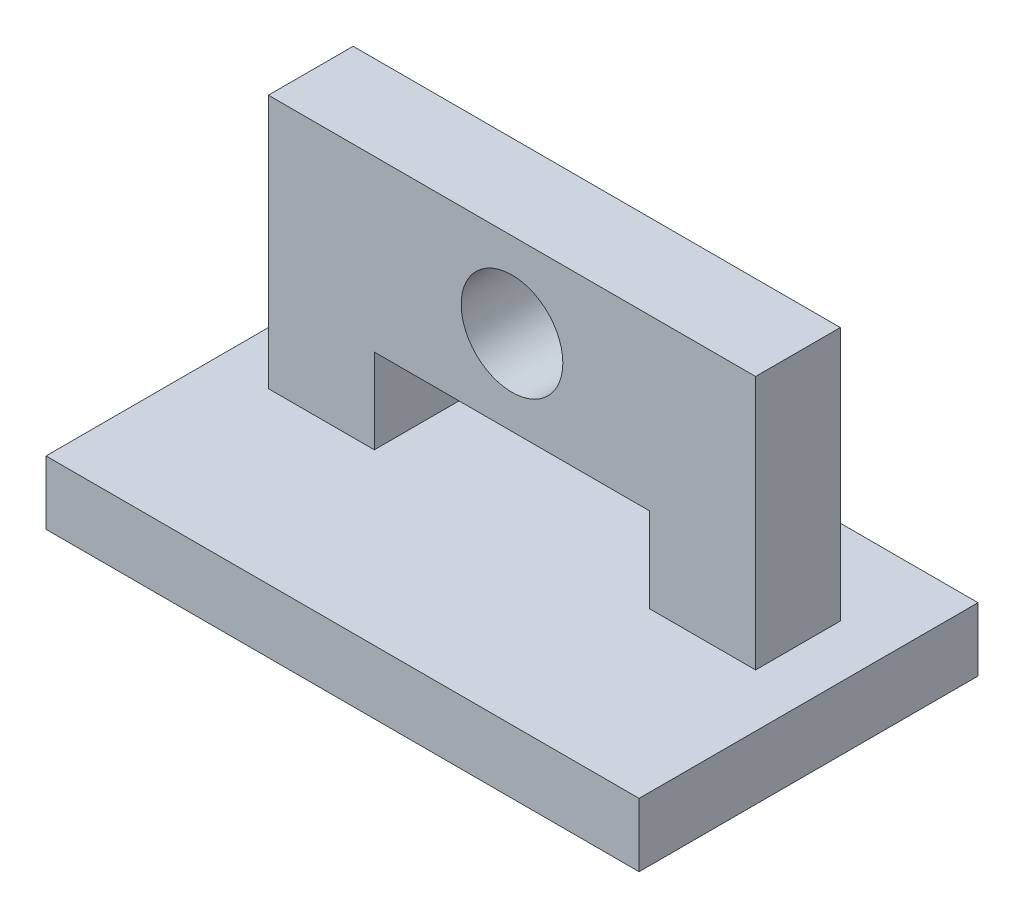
ISO-10303-21;
HEADER;
FILE_DESCRIPTION(('STEP AP214'),'2;1');
FILE_NAME('part.step','',(''),(''),'','','');
FILE_SCHEMA(('AUTOMOTIVE_DESIGN { 1 0 10303 214 1 1 1 1 }'));
ENDSEC;
DATA;
#1=APPLICATION_CONTEXT('core data for automotive mechanical design processes');
#2=APPLICATION_PROTOCOL_DEFINITION('international standard','automotive_design',2000,#1);
#3=PRODUCT_CONTEXT('',#1,'mechanical');
#4=PRODUCT('Part','Part','',(#3));
#5=PRODUCT_RELATED_PRODUCT_CATEGORY('part','',(#4));
#6=PRODUCT_DEFINITION_FORMATION('','',#4);
#7=PRODUCT_DEFINITION_CONTEXT('part definition',#1,'design');
#8=PRODUCT_DEFINITION('design','',#6,#7);
#9=PRODUCT_DEFINITION_SHAPE('','',#8);
#10=(LENGTH_UNIT() NAMED_UNIT(*) SI_UNIT(.MILLI.,.METRE.));
#11=(NAMED_UNIT(*) PLANE_ANGLE_UNIT() SI_UNIT($,.RADIAN.));
#12=(NAMED_UNIT(*) SI_UNIT($,.STERADIAN.) SOLID_ANGLE_UNIT());
#13=UNCERTAINTY_MEASURE_WITH_UNIT(LENGTH_MEASURE(1.E-05),#10,'distance_accuracy_value','');
#14=(GEOMETRIC_REPRESENTATION_CONTEXT(3) GLOBAL_UNCERTAINTY_ASSIGNED_CONTEXT((#13)) GLOBAL_UNIT_ASSIGNED_CONTEXT((#10,
#11,#12)) REPRESENTATION_CONTEXT('',''));
#15=CARTESIAN_POINT('',(0.,0.,0.));
#16=DIRECTION('',(0.,0.,1.));
#17=DIRECTION('',(1.,0.,0.));
#18=AXIS2_PLACEMENT_3D('',#15,#16,#17);
#19=CARTESIAN_POINT('',(0.,0.,0.));
#20=DIRECTION('',(0.,-1.,0.));
#21=DIRECTION('',(0.,0.,-1.));
#22=AXIS2_PLACEMENT_3D('',#19,#20,#21);
#23=PLANE('',#22);
#24=DIRECTION('',(0.,0.,1.));
#25=VECTOR('',#24,1.);
#26=CARTESIAN_POINT('',(32.5,0.,-20.));
#27=LINE('',#26,#25);
#28=CARTESIAN_POINT('',(32.5,0.,-20.));
#29=VERTEX_POINT('',#28);
#30=CARTESIAN_POINT('',(32.5,0.,0.));
#31=VERTEX_POINT('',#30);
#32=EDGE_CURVE('E126',#29,#31,#27,.T.);
#33=ORIENTED_EDGE('',*,*,#32,.F.);
#34=DIRECTION('',(1.,0.,0.));
#35=VECTOR('',#34,1.);
#36=CARTESIAN_POINT('',(32.5,0.,-20.));
#37=LINE('',#36,#35);
#38=CARTESIAN_POINT('',(57.5,0.,-20.));
#39=VERTEX_POINT('',#38);
#40=EDGE_CURVE('E157',#29,#39,#37,.T.);
#41=ORIENTED_EDGE('',*,*,#40,.T.);
#42=DIRECTION('',(0.,0.,1.));
#43=VECTOR('',#42,1.);
#44=CARTESIAN_POINT('',(57.5,0.,-20.));
#45=LINE('',#44,#43);
#46=CARTESIAN_POINT('',(57.5,0.,0.));
#47=VERTEX_POINT('',#46);
#48=EDGE_CURVE('E164',#39,#47,#45,.T.);
#49=ORIENTED_EDGE('',*,*,#48,.T.);
#50=DIRECTION('',(1.,0.,0.));
#51=VECTOR('',#50,1.);
#52=CARTESIAN_POINT('',(32.5,0.,0.));
#53=LINE('',#52,#51);
#54=EDGE_CURVE('E132',#31,#47,#53,.T.);
#55=ORIENTED_EDGE('',*,*,#54,.F.);
#56=EDGE_LOOP('',(#33,#41,#49,#55));
#57=FACE_BOUND('',#56,.T.);
#58=DIRECTION('',(0.,0.,-1.));
#59=VECTOR('',#58,1.);
#60=CARTESIAN_POINT('',(70.,0.,40.));
#61=LINE('',#60,#59);
#62=CARTESIAN_POINT('',(70.,0.,40.));
#63=VERTEX_POINT('',#62);
#64=CARTESIAN_POINT('',(70.,0.,-40.));
#65=VERTEX_POINT('',#64);
#66=EDGE_CURVE('E192',#63,#65,#61,.T.);
#67=ORIENTED_EDGE('',*,*,#66,.T.);
#68=DIRECTION('',(-1.,0.,0.));
#69=VECTOR('',#68,1.);
#70=CARTESIAN_POINT('',(-70.,0.,-40.));
#71=LINE('',#70,#69);
#72=CARTESIAN_POINT('',(-70.,0.,-40.));
#73=VERTEX_POINT('',#72);
#74=EDGE_CURVE('E215',#65,#73,#71,.T.);
#75=ORIENTED_EDGE('',*,*,#74,.T.);
#76=DIRECTION('',(0.,0.,1.));
#77=VECTOR('',#76,1.);
#78=CARTESIAN_POINT('',(-70.,0.,40.));
#79=LINE('',#78,#77);
#80=CARTESIAN_POINT('',(-70.,0.,40.));
#81=VERTEX_POINT('',#80);
#82=EDGE_CURVE('E214',#73,#81,#79,.T.);
#83=ORIENTED_EDGE('',*,*,#82,.T.);
#84=DIRECTION('',(1.,0.,0.));
#85=VECTOR('',#84,1.);
#86=CARTESIAN_POINT('',(-70.,0.,40.));
#87=LINE('',#86,#85);
#88=EDGE_CURVE('E199',#81,#63,#87,.T.);
#89=ORIENTED_EDGE('',*,*,#88,.T.);
#90=EDGE_LOOP('',(#67,#75,#83,#89));
#91=FACE_BOUND('',#90,.T.);
#92=DIRECTION('',(1.,0.,0.));
#93=VECTOR('',#92,1.);
#94=CARTESIAN_POINT('',(-57.5,0.,0.));
#95=LINE('',#94,#93);
#96=CARTESIAN_POINT('',(-57.5,0.,0.));
#97=VERTEX_POINT('',#96);
#98=CARTESIAN_POINT('',(-32.5,0.,0.));
#99=VERTEX_POINT('',#98);
#100=EDGE_CURVE('E172',#97,#99,#95,.T.);
#101=ORIENTED_EDGE('',*,*,#100,.F.);
#102=DIRECTION('',(0.,0.,1.));
#103=VECTOR('',#102,1.);
#104=CARTESIAN_POINT('',(-57.5,0.,-20.));
#105=LINE('',#104,#103);
#106=CARTESIAN_POINT('',(-57.5,0.,-20.));
#107=VERTEX_POINT('',#106);
#108=EDGE_CURVE('E195',#107,#97,#105,.T.);
#109=ORIENTED_EDGE('',*,*,#108,.F.);
#110=DIRECTION('',(1.,0.,0.));
#111=VECTOR('',#110,1.);
#112=CARTESIAN_POINT('',(-57.5,0.,-20.));
#113=LINE('',#112,#111);
#114=CARTESIAN_POINT('',(-32.5,0.,-20.));
#115=VERTEX_POINT('',#114);
#116=EDGE_CURVE('E180',#107,#115,#113,.T.);
#117=ORIENTED_EDGE('',*,*,#116,.T.);
#118=DIRECTION('',(0.,0.,1.));
#119=VECTOR('',#118,1.);
#120=CARTESIAN_POINT('',(-32.5,0.,-20.));
#121=LINE('',#120,#119);
#122=EDGE_CURVE('E187',#115,#99,#121,.T.);
#123=ORIENTED_EDGE('',*,*,#122,.T.);
#124=EDGE_LOOP('',(#101,#109,#117,#123));
#125=FACE_BOUND('',#124,.T.);
#126=ADVANCED_FACE('F39',(#57,#91,#125),#23,.F.);
#127=CARTESIAN_POINT('',(70.,-15.,40.));
#128=DIRECTION('',(1.,0.,0.));
#129=DIRECTION('',(0.,0.,-1.));
#130=AXIS2_PLACEMENT_3D('',#127,#128,#129);
#131=PLANE('',#130);
#132=ORIENTED_EDGE('',*,*,#66,.F.);
#133=DIRECTION('',(0.,1.,0.));
#134=VECTOR('',#133,1.);
#135=CARTESIAN_POINT('',(70.,-15.,40.));
#136=LINE('',#135,#134);
#137=CARTESIAN_POINT('',(70.,-15.,40.));
#138=VERTEX_POINT('',#137);
#139=EDGE_CURVE('E50',#138,#63,#136,.T.);
#140=ORIENTED_EDGE('',*,*,#139,.F.);
#141=DIRECTION('',(0.,0.,-1.));
#142=VECTOR('',#141,1.);
#143=CARTESIAN_POINT('',(70.,-15.,40.));
#144=LINE('',#143,#142);
#145=CARTESIAN_POINT('',(70.,-15.,-40.));
#146=VERTEX_POINT('',#145);
#147=EDGE_CURVE('E198',#138,#146,#144,.T.);
#148=ORIENTED_EDGE('',*,*,#147,.T.);
#149=DIRECTION('',(0.,1.,0.));
#150=VECTOR('',#149,1.);
#151=CARTESIAN_POINT('',(70.,-15.,-40.));
#152=LINE('',#151,#150);
#153=EDGE_CURVE('E207',#146,#65,#152,.T.);
#154=ORIENTED_EDGE('',*,*,#153,.T.);
#155=EDGE_LOOP('',(#132,#140,#148,#154));
#156=FACE_BOUND('',#155,.T.);
#157=ADVANCED_FACE('F41',(#156),#131,.T.);
#158=CARTESIAN_POINT('',(-70.,-15.,40.));
#159=DIRECTION('',(0.,0.,1.));
#160=DIRECTION('',(1.,0.,0.));
#161=AXIS2_PLACEMENT_3D('',#158,#159,#160);
#162=PLANE('',#161);
#163=ORIENTED_EDGE('',*,*,#88,.F.);
#164=DIRECTION('',(0.,1.,0.));
#165=VECTOR('',#164,1.);
#166=CARTESIAN_POINT('',(-70.,-15.,40.));
#167=LINE('',#166,#165);
#168=CARTESIAN_POINT('',(-70.,-15.,40.));
#169=VERTEX_POINT('',#168);
#170=EDGE_CURVE('E222',#169,#81,#167,.T.);
#171=ORIENTED_EDGE('',*,*,#170,.F.);
#172=DIRECTION('',(1.,0.,0.));
#173=VECTOR('',#172,1.);
#174=CARTESIAN_POINT('',(-70.,-15.,40.));
#175=LINE('',#174,#173);
#176=EDGE_CURVE('E206',#169,#138,#175,.T.);
#177=ORIENTED_EDGE('',*,*,#176,.T.);
#178=ORIENTED_EDGE('',*,*,#139,.T.);
#179=EDGE_LOOP('',(#163,#171,#177,#178));
#180=FACE_BOUND('',#179,.T.);
#181=ADVANCED_FACE('F237',(#180),#162,.T.);
#182=CARTESIAN_POINT('',(-70.,-15.,40.));
#183=DIRECTION('',(-1.,0.,0.));
#184=DIRECTION('',(0.,0.,1.));
#185=AXIS2_PLACEMENT_3D('',#182,#183,#184);
#186=PLANE('',#185);
#187=ORIENTED_EDGE('',*,*,#82,.F.);
#188=DIRECTION('',(0.,1.,0.));
#189=VECTOR('',#188,1.);
#190=CARTESIAN_POINT('',(-70.,-15.,-40.));
#191=LINE('',#190,#189);
#192=CARTESIAN_POINT('',(-70.,-15.,-40.));
#193=VERTEX_POINT('',#192);
#194=EDGE_CURVE('E224',#193,#73,#191,.T.);
#195=ORIENTED_EDGE('',*,*,#194,.F.);
#196=DIRECTION('',(0.,0.,1.));
#197=VECTOR('',#196,1.);
#198=CARTESIAN_POINT('',(-70.,-15.,40.));
#199=LINE('',#198,#197);
#200=EDGE_CURVE('E201',#193,#169,#199,.T.);
#201=ORIENTED_EDGE('',*,*,#200,.T.);
#202=ORIENTED_EDGE('',*,*,#170,.T.);
#203=EDGE_LOOP('',(#187,#195,#201,#202));
#204=FACE_BOUND('',#203,.T.);
#205=ADVANCED_FACE('F244',(#204),#186,.T.);
#206=CARTESIAN_POINT('',(-70.,-15.,-40.));
#207=DIRECTION('',(0.,0.,-1.));
#208=DIRECTION('',(-1.,0.,0.));
#209=AXIS2_PLACEMENT_3D('',#206,#207,#208);
#210=PLANE('',#209);
#211=ORIENTED_EDGE('',*,*,#74,.F.);
#212=ORIENTED_EDGE('',*,*,#153,.F.);
#213=DIRECTION('',(-1.,0.,0.));
#214=VECTOR('',#213,1.);
#215=CARTESIAN_POINT('',(-70.,-15.,-40.));
#216=LINE('',#215,#214);
#217=EDGE_CURVE('E200',#146,#193,#216,.T.);
#218=ORIENTED_EDGE('',*,*,#217,.T.);
#219=ORIENTED_EDGE('',*,*,#194,.T.);
#220=EDGE_LOOP('',(#211,#212,#218,#219));
#221=FACE_BOUND('',#220,.T.);
#222=ADVANCED_FACE('F226',(#221),#210,.T.);
#223=CARTESIAN_POINT('',(0.,-15.,0.));
#224=DIRECTION('',(0.,-1.,0.));
#225=DIRECTION('',(0.,0.,-1.));
#226=AXIS2_PLACEMENT_3D('',#223,#224,#225);
#227=PLANE('',#226);
#228=ORIENTED_EDGE('',*,*,#147,.F.);
#229=ORIENTED_EDGE('',*,*,#176,.F.);
#230=ORIENTED_EDGE('',*,*,#200,.F.);
#231=ORIENTED_EDGE('',*,*,#217,.F.);
#232=EDGE_LOOP('',(#228,#229,#230,#231));
#233=FACE_BOUND('',#232,.T.);
#234=ADVANCED_FACE('F239',(#233),#227,.T.);
#235=CARTESIAN_POINT('',(-32.5,0.,-20.));
#236=DIRECTION('',(1.,0.,0.));
#237=DIRECTION('',(0.,0.,-1.));
#238=AXIS2_PLACEMENT_3D('',#235,#236,#237);
#239=PLANE('',#238);
#240=DIRECTION('',(0.,0.,-1.));
#241=VECTOR('',#240,1.);
#242=CARTESIAN_POINT('',(-32.5,20.,-20.));
#243=LINE('',#242,#241);
#244=CARTESIAN_POINT('',(-32.5,20.,0.));
#245=VERTEX_POINT('',#244);
#246=CARTESIAN_POINT('',(-32.5,20.,-20.));
#247=VERTEX_POINT('',#246);
#248=EDGE_CURVE('E53',#245,#247,#243,.T.);
#249=ORIENTED_EDGE('',*,*,#248,.F.);
#250=DIRECTION('',(0.,1.,0.));
#251=VECTOR('',#250,1.);
#252=CARTESIAN_POINT('',(-32.5,0.,0.));
#253=LINE('',#252,#251);
#254=EDGE_CURVE('E145',#99,#245,#253,.T.);
#255=ORIENTED_EDGE('',*,*,#254,.F.);
#256=ORIENTED_EDGE('',*,*,#122,.F.);
#257=DIRECTION('',(0.,1.,0.));
#258=VECTOR('',#257,1.);
#259=CARTESIAN_POINT('',(-32.5,0.,-20.));
#260=LINE('',#259,#258);
#261=EDGE_CURVE('E168',#115,#247,#260,.T.);
#262=ORIENTED_EDGE('',*,*,#261,.T.);
#263=EDGE_LOOP('',(#249,#255,#256,#262));
#264=FACE_BOUND('',#263,.T.);
#265=ADVANCED_FACE('F261',(#264),#239,.T.);
#266=CARTESIAN_POINT('',(-57.5,0.,-20.));
#267=DIRECTION('',(-1.,0.,0.));
#268=DIRECTION('',(0.,0.,1.));
#269=AXIS2_PLACEMENT_3D('',#266,#267,#268);
#270=PLANE('',#269);
#271=DIRECTION('',(0.,-1.,0.));
#272=VECTOR('',#271,1.);
#273=CARTESIAN_POINT('',(-57.5,0.,0.));
#274=LINE('',#273,#272);
#275=CARTESIAN_POINT('',(-57.5,60.,0.));
#276=VERTEX_POINT('',#275);
#277=EDGE_CURVE('E184',#276,#97,#274,.T.);
#278=ORIENTED_EDGE('',*,*,#277,.F.);
#279=DIRECTION('',(0.,0.,1.));
#280=VECTOR('',#279,1.);
#281=CARTESIAN_POINT('',(-57.5,60.,-20.));
#282=LINE('',#281,#280);
#283=CARTESIAN_POINT('',(-57.5,60.,-20.));
#284=VERTEX_POINT('',#283);
#285=EDGE_CURVE('E176',#284,#276,#282,.T.);
#286=ORIENTED_EDGE('',*,*,#285,.F.);
#287=DIRECTION('',(0.,-1.,0.));
#288=VECTOR('',#287,1.);
#289=CARTESIAN_POINT('',(-57.5,0.,-20.));
#290=LINE('',#289,#288);
#291=EDGE_CURVE('E171',#284,#107,#290,.T.);
#292=ORIENTED_EDGE('',*,*,#291,.T.);
#293=ORIENTED_EDGE('',*,*,#108,.T.);
#294=EDGE_LOOP('',(#278,#286,#292,#293));
#295=FACE_BOUND('',#294,.T.);
#296=ADVANCED_FACE('F262',(#295),#270,.T.);
#297=CARTESIAN_POINT('',(-57.5,60.,-20.));
#298=DIRECTION('',(0.,1.,0.));
#299=DIRECTION('',(0.,0.,1.));
#300=AXIS2_PLACEMENT_3D('',#297,#298,#299);
#301=PLANE('',#300);
#302=ORIENTED_EDGE('',*,*,#285,.T.);
#303=DIRECTION('',(-1.,0.,0.));
#304=VECTOR('',#303,1.);
#305=CARTESIAN_POINT('',(-57.5,60.,0.));
#306=LINE('',#305,#304);
#307=CARTESIAN_POINT('',(57.5,60.,0.));
#308=VERTEX_POINT('',#307);
#309=EDGE_CURVE('E185',#308,#276,#306,.T.);
#310=ORIENTED_EDGE('',*,*,#309,.F.);
#311=DIRECTION('',(0.,0.,1.));
#312=VECTOR('',#311,1.);
#313=CARTESIAN_POINT('',(57.5,60.,-20.));
#314=LINE('',#313,#312);
#315=CARTESIAN_POINT('',(57.5,60.,-20.));
#316=VERTEX_POINT('',#315);
#317=EDGE_CURVE('E161',#316,#308,#314,.T.);
#318=ORIENTED_EDGE('',*,*,#317,.F.);
#319=DIRECTION('',(-1.,0.,0.));
#320=VECTOR('',#319,1.);
#321=CARTESIAN_POINT('',(-57.5,60.,-20.));
#322=LINE('',#321,#320);
#323=EDGE_CURVE('E174',#316,#284,#322,.T.);
#324=ORIENTED_EDGE('',*,*,#323,.T.);
#325=EDGE_LOOP('',(#302,#310,#318,#324));
#326=FACE_BOUND('',#325,.T.);
#327=ADVANCED_FACE('F264',(#326),#301,.T.);
#328=CARTESIAN_POINT('',(0.,0.,-20.));
#329=DIRECTION('',(0.,0.,-1.));
#330=DIRECTION('',(-1.,0.,0.));
#331=AXIS2_PLACEMENT_3D('',#328,#329,#330);
#332=PLANE('',#331);
#333=CARTESIAN_POINT('',(0.,40.,-20.));
#334=DIRECTION('',(0.,0.,1.));
#335=DIRECTION('',(1.,0.,0.));
#336=AXIS2_PLACEMENT_3D('',#333,#334,#335);
#337=CIRCLE('',#336,12.);
#338=CARTESIAN_POINT('',(12.,40.,-20.));
#339=VERTEX_POINT('',#338);
#340=EDGE_CURVE('E144',#339,#339,#337,.T.);
#341=ORIENTED_EDGE('',*,*,#340,.T.);
#342=EDGE_LOOP('',(#341));
#343=FACE_BOUND('',#342,.T.);
#344=ORIENTED_EDGE('',*,*,#323,.F.);
#345=DIRECTION('',(0.,1.,0.));
#346=VECTOR('',#345,1.);
#347=CARTESIAN_POINT('',(57.5,0.,-20.));
#348=LINE('',#347,#346);
#349=EDGE_CURVE('E152',#39,#316,#348,.T.);
#350=ORIENTED_EDGE('',*,*,#349,.F.);
#351=ORIENTED_EDGE('',*,*,#40,.F.);
#352=DIRECTION('',(0.,-1.,0.));
#353=VECTOR('',#352,1.);
#354=CARTESIAN_POINT('',(32.5,0.,-20.));
#355=LINE('',#354,#353);
#356=CARTESIAN_POINT('',(32.5,20.,-20.));
#357=VERTEX_POINT('',#356);
#358=EDGE_CURVE('E160',#357,#29,#355,.T.);
#359=ORIENTED_EDGE('',*,*,#358,.F.);
#360=DIRECTION('',(1.,0.,0.));
#361=VECTOR('',#360,1.);
#362=CARTESIAN_POINT('',(-35.,20.,-20.));
#363=LINE('',#362,#361);
#364=EDGE_CURVE('E142',#247,#357,#363,.T.);
#365=ORIENTED_EDGE('',*,*,#364,.F.);
#366=ORIENTED_EDGE('',*,*,#261,.F.);
#367=ORIENTED_EDGE('',*,*,#116,.F.);
#368=ORIENTED_EDGE('',*,*,#291,.F.);
#369=EDGE_LOOP('',(#344,#350,#351,#359,#365,#366,#367,#368));
#370=FACE_BOUND('',#369,.T.);
#371=ADVANCED_FACE('F268',(#343,#370),#332,.T.);
#372=CARTESIAN_POINT('',(0.,0.,0.));
#373=DIRECTION('',(0.,0.,-1.));
#374=DIRECTION('',(-1.,0.,0.));
#375=AXIS2_PLACEMENT_3D('',#372,#373,#374);
#376=PLANE('',#375);
#377=CARTESIAN_POINT('',(0.,40.,0.));
#378=DIRECTION('',(0.,0.,1.));
#379=DIRECTION('',(1.,0.,0.));
#380=AXIS2_PLACEMENT_3D('',#377,#378,#379);
#381=CIRCLE('',#380,12.);
#382=CARTESIAN_POINT('',(12.,40.,0.));
#383=VERTEX_POINT('',#382);
#384=EDGE_CURVE('E149',#383,#383,#381,.T.);
#385=ORIENTED_EDGE('',*,*,#384,.F.);
#386=EDGE_LOOP('',(#385));
#387=FACE_BOUND('',#386,.T.);
#388=ORIENTED_EDGE('',*,*,#309,.T.);
#389=ORIENTED_EDGE('',*,*,#277,.T.);
#390=ORIENTED_EDGE('',*,*,#100,.T.);
#391=ORIENTED_EDGE('',*,*,#254,.T.);
#392=DIRECTION('',(1.,0.,0.));
#393=VECTOR('',#392,1.);
#394=CARTESIAN_POINT('',(-35.,20.,0.));
#395=LINE('',#394,#393);
#396=CARTESIAN_POINT('',(32.5,20.,0.));
#397=VERTEX_POINT('',#396);
#398=EDGE_CURVE('E136',#245,#397,#395,.T.);
#399=ORIENTED_EDGE('',*,*,#398,.T.);
#400=DIRECTION('',(0.,-1.,0.));
#401=VECTOR('',#400,1.);
#402=CARTESIAN_POINT('',(32.5,0.,0.));
#403=LINE('',#402,#401);
#404=EDGE_CURVE('E121',#397,#31,#403,.T.);
#405=ORIENTED_EDGE('',*,*,#404,.T.);
#406=ORIENTED_EDGE('',*,*,#54,.T.);
#407=DIRECTION('',(0.,1.,0.));
#408=VECTOR('',#407,1.);
#409=CARTESIAN_POINT('',(57.5,0.,0.));
#410=LINE('',#409,#408);
#411=EDGE_CURVE('E135',#47,#308,#410,.T.);
#412=ORIENTED_EDGE('',*,*,#411,.T.);
#413=EDGE_LOOP('',(#388,#389,#390,#391,#399,#405,#406,#412));
#414=FACE_BOUND('',#413,.T.);
#415=ADVANCED_FACE('F141',(#387,#414),#376,.F.);
#416=CARTESIAN_POINT('',(57.5,0.,-20.));
#417=DIRECTION('',(1.,0.,0.));
#418=DIRECTION('',(0.,0.,-1.));
#419=AXIS2_PLACEMENT_3D('',#416,#417,#418);
#420=PLANE('',#419);
#421=ORIENTED_EDGE('',*,*,#411,.F.);
#422=ORIENTED_EDGE('',*,*,#48,.F.);
#423=ORIENTED_EDGE('',*,*,#349,.T.);
#424=ORIENTED_EDGE('',*,*,#317,.T.);
#425=EDGE_LOOP('',(#421,#422,#423,#424));
#426=FACE_BOUND('',#425,.T.);
#427=ADVANCED_FACE('F273',(#426),#420,.T.);
#428=CARTESIAN_POINT('',(32.5,0.,-20.));
#429=DIRECTION('',(-1.,0.,0.));
#430=DIRECTION('',(0.,0.,1.));
#431=AXIS2_PLACEMENT_3D('',#428,#429,#430);
#432=PLANE('',#431);
#433=DIRECTION('',(0.,0.,1.));
#434=VECTOR('',#433,1.);
#435=CARTESIAN_POINT('',(32.5,20.,-20.));
#436=LINE('',#435,#434);
#437=EDGE_CURVE('E11',#357,#397,#436,.T.);
#438=ORIENTED_EDGE('',*,*,#437,.F.);
#439=ORIENTED_EDGE('',*,*,#358,.T.);
#440=ORIENTED_EDGE('',*,*,#32,.T.);
#441=ORIENTED_EDGE('',*,*,#404,.F.);
#442=EDGE_LOOP('',(#438,#439,#440,#441));
#443=FACE_BOUND('',#442,.T.);
#444=ADVANCED_FACE('F127',(#443),#432,.T.);
#445=CARTESIAN_POINT('',(-35.,20.,-20.));
#446=DIRECTION('',(0.,-1.,0.));
#447=DIRECTION('',(0.,0.,-1.));
#448=AXIS2_PLACEMENT_3D('',#445,#446,#447);
#449=PLANE('',#448);
#450=ORIENTED_EDGE('',*,*,#398,.F.);
#451=ORIENTED_EDGE('',*,*,#248,.T.);
#452=ORIENTED_EDGE('',*,*,#364,.T.);
#453=ORIENTED_EDGE('',*,*,#437,.T.);
#454=EDGE_LOOP('',(#450,#451,#452,#453));
#455=FACE_BOUND('',#454,.T.);
#456=ADVANCED_FACE('F139',(#455),#449,.T.);
#457=CARTESIAN_POINT('',(0.,40.,-20.));
#458=DIRECTION('',(0.,0.,1.));
#459=DIRECTION('',(1.,0.,0.));
#460=AXIS2_PLACEMENT_3D('',#457,#458,#459);
#461=CYLINDRICAL_SURFACE('',#460,12.);
#462=ORIENTED_EDGE('',*,*,#340,.F.);
#463=EDGE_LOOP('',(#462));
#464=FACE_BOUND('',#463,.T.);
#465=ORIENTED_EDGE('',*,*,#384,.T.);
#466=EDGE_LOOP('',(#465));
#467=FACE_BOUND('',#466,.T.);
#468=ADVANCED_FACE('F281',(#464,#467),#461,.F.);
#469=CLOSED_SHELL('',(#126,#157,#181,#205,#222,#234,#265,#296,#327,#371,#415,#427,#444,#456,#468));
#470=MANIFOLD_SOLID_BREP('B2',#469);
#471=ADVANCED_BREP_SHAPE_REPRESENTATION('',(#18,#470),#14);
#472=SHAPE_DEFINITION_REPRESENTATION(#9,#471);
ENDSEC;
END-ISO-10303-21;
